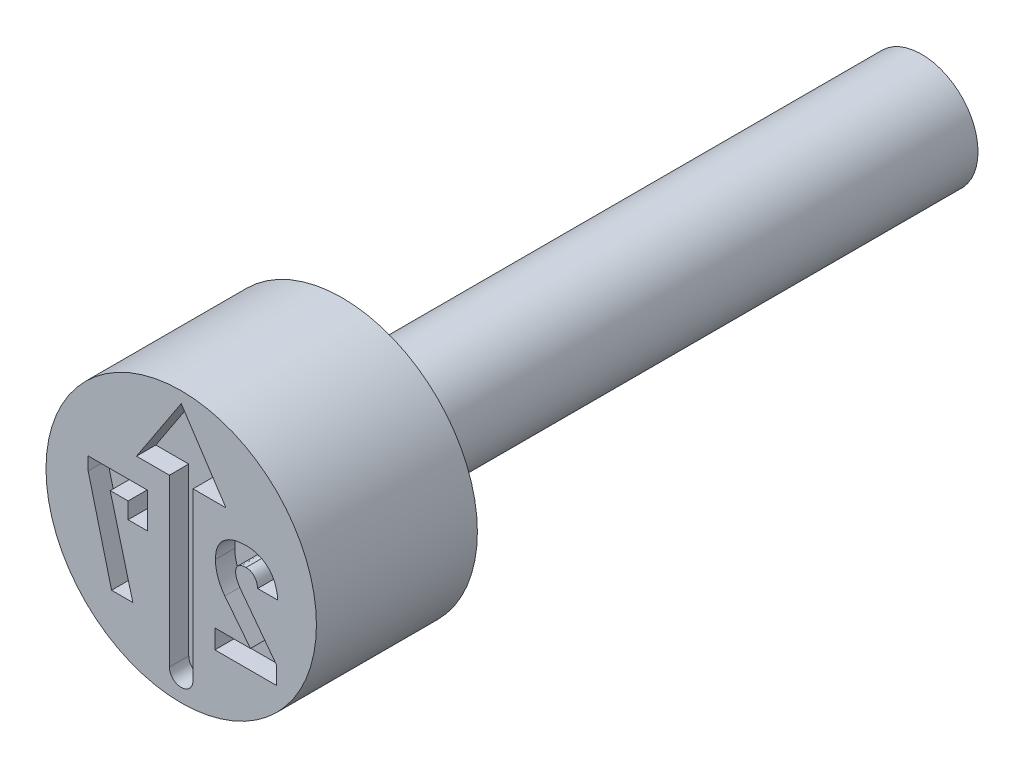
ISO-10303-21;
HEADER;
FILE_DESCRIPTION(('STEP AP214'),'2;1');
FILE_NAME('part.step','',(''),(''),'','','');
FILE_SCHEMA(('AUTOMOTIVE_DESIGN { 1 0 10303 214 1 1 1 1 }'));
ENDSEC;
DATA;
#1=APPLICATION_CONTEXT('core data for automotive mechanical design processes');
#2=APPLICATION_PROTOCOL_DEFINITION('international standard','automotive_design',2000,#1);
#3=PRODUCT_CONTEXT('',#1,'mechanical');
#4=PRODUCT('Part','Part','',(#3));
#5=PRODUCT_RELATED_PRODUCT_CATEGORY('part','',(#4));
#6=PRODUCT_DEFINITION_FORMATION('','',#4);
#7=PRODUCT_DEFINITION_CONTEXT('part definition',#1,'design');
#8=PRODUCT_DEFINITION('design','',#6,#7);
#9=PRODUCT_DEFINITION_SHAPE('','',#8);
#10=(LENGTH_UNIT() NAMED_UNIT(*) SI_UNIT(.MILLI.,.METRE.));
#11=(NAMED_UNIT(*) PLANE_ANGLE_UNIT() SI_UNIT($,.RADIAN.));
#12=(NAMED_UNIT(*) SI_UNIT($,.STERADIAN.) SOLID_ANGLE_UNIT());
#13=UNCERTAINTY_MEASURE_WITH_UNIT(LENGTH_MEASURE(1.E-05),#10,'distance_accuracy_value','');
#14=(GEOMETRIC_REPRESENTATION_CONTEXT(3) GLOBAL_UNCERTAINTY_ASSIGNED_CONTEXT((#13)) GLOBAL_UNIT_ASSIGNED_CONTEXT((#10,
#11,#12)) REPRESENTATION_CONTEXT('',''));
#15=CARTESIAN_POINT('',(0.,0.,0.));
#16=DIRECTION('',(0.,0.,1.));
#17=DIRECTION('',(1.,0.,0.));
#18=AXIS2_PLACEMENT_3D('',#15,#16,#17);
#19=CARTESIAN_POINT('',(0.,1.75,-5.));
#20=DIRECTION('',(0.,0.,1.));
#21=DIRECTION('',(1.,0.,0.));
#22=AXIS2_PLACEMENT_3D('',#19,#20,#21);
#23=PLANE('',#22);
#24=CARTESIAN_POINT('',(0.,0.,-5.));
#25=DIRECTION('',(0.,0.,1.));
#26=DIRECTION('',(1.,0.,0.));
#27=AXIS2_PLACEMENT_3D('',#24,#25,#26);
#28=CIRCLE('',#27,4.2);
#29=CARTESIAN_POINT('',(4.2,0.,-5.));
#30=VERTEX_POINT('',#29);
#31=EDGE_CURVE('E11',#30,#30,#28,.T.);
#32=ORIENTED_EDGE('',*,*,#31,.F.);
#33=EDGE_LOOP('',(#32));
#34=FACE_BOUND('',#33,.T.);
#35=CARTESIAN_POINT('',(0.,0.,-5.));
#36=DIRECTION('',(0.,0.,1.));
#37=DIRECTION('',(1.,0.,0.));
#38=AXIS2_PLACEMENT_3D('',#35,#36,#37);
#39=CIRCLE('',#38,1.75);
#40=CARTESIAN_POINT('',(1.75,0.,-5.));
#41=VERTEX_POINT('',#40);
#42=EDGE_CURVE('E430',#41,#41,#39,.T.);
#43=ORIENTED_EDGE('',*,*,#42,.T.);
#44=EDGE_LOOP('',(#43));
#45=FACE_BOUND('',#44,.T.);
#46=ADVANCED_FACE('F39',(#34,#45),#23,.F.);
#47=CARTESIAN_POINT('',(0.,0.,-0.403888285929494));
#48=DIRECTION('',(0.,0.,1.));
#49=DIRECTION('',(1.,0.,0.));
#50=AXIS2_PLACEMENT_3D('',#47,#48,#49);
#51=CYLINDRICAL_SURFACE('',#50,4.2);
#52=CARTESIAN_POINT('',(0.,0.,0.));
#53=DIRECTION('',(0.,0.,1.));
#54=DIRECTION('',(1.,0.,0.));
#55=AXIS2_PLACEMENT_3D('',#52,#53,#54);
#56=CIRCLE('',#55,4.2);
#57=CARTESIAN_POINT('',(4.2,0.,0.));
#58=VERTEX_POINT('',#57);
#59=EDGE_CURVE('E46',#58,#58,#56,.T.);
#60=ORIENTED_EDGE('',*,*,#59,.F.);
#61=EDGE_LOOP('',(#60));
#62=FACE_BOUND('',#61,.T.);
#63=ORIENTED_EDGE('',*,*,#31,.T.);
#64=EDGE_LOOP('',(#63));
#65=FACE_BOUND('',#64,.T.);
#66=ADVANCED_FACE('F415',(#62,#65),#51,.T.);
#67=CARTESIAN_POINT('',(0.,4.2,0.));
#68=DIRECTION('',(0.,0.,-1.));
#69=DIRECTION('',(-1.,0.,0.));
#70=AXIS2_PLACEMENT_3D('',#67,#68,#69);
#71=PLANE('',#70);
#72=DIRECTION('',(0.,-1.,0.));
#73=VECTOR('',#72,1.);
#74=CARTESIAN_POINT('',(-2.88900162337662,1.,0.));
#75=LINE('',#74,#73);
#76=CARTESIAN_POINT('',(-2.88900162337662,1.,0.));
#77=VERTEX_POINT('',#76);
#78=CARTESIAN_POINT('',(-2.88900162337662,0.592431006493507,0.));
#79=VERTEX_POINT('',#78);
#80=EDGE_CURVE('E297',#77,#79,#75,.T.);
#81=ORIENTED_EDGE('',*,*,#80,.F.);
#82=DIRECTION('',(-1.,0.,0.));
#83=VECTOR('',#82,1.);
#84=CARTESIAN_POINT('',(-1.03977272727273,1.,0.));
#85=LINE('',#84,#83);
#86=CARTESIAN_POINT('',(-1.03977272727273,1.,0.));
#87=VERTEX_POINT('',#86);
#88=EDGE_CURVE('E53',#87,#77,#85,.T.);
#89=ORIENTED_EDGE('',*,*,#88,.F.);
#90=DIRECTION('',(0.,1.,0.));
#91=VECTOR('',#90,1.);
#92=CARTESIAN_POINT('',(-1.03977272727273,-0.0974025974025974,0.));
#93=LINE('',#92,#91);
#94=CARTESIAN_POINT('',(-1.03977272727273,-0.0974025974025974,0.));
#95=VERTEX_POINT('',#94);
#96=EDGE_CURVE('E274',#95,#87,#93,.T.);
#97=ORIENTED_EDGE('',*,*,#96,.F.);
#98=DIRECTION('',(1.,0.,0.));
#99=VECTOR('',#98,1.);
#100=CARTESIAN_POINT('',(-1.64980722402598,-0.0974025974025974,0.));
#101=LINE('',#100,#99);
#102=CARTESIAN_POINT('',(-1.64980722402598,-0.0974025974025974,0.));
#103=VERTEX_POINT('',#102);
#104=EDGE_CURVE('E277',#103,#95,#101,.T.);
#105=ORIENTED_EDGE('',*,*,#104,.F.);
#106=DIRECTION('',(0.,-1.,0.));
#107=VECTOR('',#106,1.);
#108=CARTESIAN_POINT('',(-1.64980722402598,0.409090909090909,0.));
#109=LINE('',#108,#107);
#110=CARTESIAN_POINT('',(-1.64980722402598,0.409090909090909,0.));
#111=VERTEX_POINT('',#110);
#112=EDGE_CURVE('E311',#111,#103,#109,.T.);
#113=ORIENTED_EDGE('',*,*,#112,.F.);
#114=DIRECTION('',(1.,0.,0.));
#115=VECTOR('',#114,1.);
#116=CARTESIAN_POINT('',(-2.20576298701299,0.409090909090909,0.));
#117=LINE('',#116,#115);
#118=CARTESIAN_POINT('',(-2.20576298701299,0.409090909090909,0.));
#119=VERTEX_POINT('',#118);
#120=EDGE_CURVE('E308',#119,#111,#117,.T.);
#121=ORIENTED_EDGE('',*,*,#120,.F.);
#122=DIRECTION('',(-0.255602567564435,0.966781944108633,0.));
#123=VECTOR('',#122,1.);
#124=CARTESIAN_POINT('',(-1.50273944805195,-2.25,0.));
#125=LINE('',#124,#123);
#126=CARTESIAN_POINT('',(-1.50273944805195,-2.25,0.));
#127=VERTEX_POINT('',#126);
#128=EDGE_CURVE('E305',#127,#119,#125,.T.);
#129=ORIENTED_EDGE('',*,*,#128,.F.);
#130=DIRECTION('',(1.,0.,0.));
#131=VECTOR('',#130,1.);
#132=CARTESIAN_POINT('',(-2.1635551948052,-2.25,0.));
#133=LINE('',#132,#131);
#134=CARTESIAN_POINT('',(-2.1635551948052,-2.25,0.));
#135=VERTEX_POINT('',#134);
#136=EDGE_CURVE('E302',#135,#127,#133,.T.);
#137=ORIENTED_EDGE('',*,*,#136,.F.);
#138=DIRECTION('',(0.247293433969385,-0.968940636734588,0.));
#139=VECTOR('',#138,1.);
#140=CARTESIAN_POINT('',(-2.88900162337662,0.592431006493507,0.));
#141=LINE('',#140,#139);
#142=EDGE_CURVE('E299',#79,#135,#141,.T.);
#143=ORIENTED_EDGE('',*,*,#142,.F.);
#144=EDGE_LOOP('',(#81,#89,#97,#105,#113,#121,#129,#137,#143));
#145=FACE_BOUND('',#144,.T.);
#146=DIRECTION('',(0.,1.,0.));
#147=VECTOR('',#146,1.);
#148=CARTESIAN_POINT('',(2.95928368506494,-2.25,0.));
#149=LINE('',#148,#147);
#150=CARTESIAN_POINT('',(2.95928368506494,-2.25,0.));
#151=VERTEX_POINT('',#150);
#152=CARTESIAN_POINT('',(2.95928368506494,-1.69734172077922,0.));
#153=VERTEX_POINT('',#152);
#154=EDGE_CURVE('E602',#151,#153,#149,.T.);
#155=ORIENTED_EDGE('',*,*,#154,.F.);
#156=DIRECTION('',(1.,0.,0.));
#157=VECTOR('',#156,1.);
#158=CARTESIAN_POINT('',(1.04542410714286,-2.25,0.));
#159=LINE('',#158,#157);
#160=CARTESIAN_POINT('',(1.04542410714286,-2.25,0.));
#161=VERTEX_POINT('',#160);
#162=EDGE_CURVE('E61',#161,#151,#159,.T.);
#163=ORIENTED_EDGE('',*,*,#162,.F.);
#164=DIRECTION('',(0.,-1.,0.));
#165=VECTOR('',#164,1.);
#166=CARTESIAN_POINT('',(1.04542410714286,-1.65909090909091,0.));
#167=LINE('',#166,#165);
#168=CARTESIAN_POINT('',(1.04542410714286,-1.65909090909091,0.));
#169=VERTEX_POINT('',#168);
#170=EDGE_CURVE('E335',#169,#161,#167,.T.);
#171=ORIENTED_EDGE('',*,*,#170,.F.);
#172=DIRECTION('',(-1.,0.,0.));
#173=VECTOR('',#172,1.);
#174=CARTESIAN_POINT('',(2.15140016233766,-1.65909090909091,0.));
#175=LINE('',#174,#173);
#176=CARTESIAN_POINT('',(2.15140016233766,-1.65909090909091,0.));
#177=VERTEX_POINT('',#176);
#178=EDGE_CURVE('E530',#177,#169,#175,.T.);
#179=ORIENTED_EDGE('',*,*,#178,.F.);
#180=DIRECTION('',(0.618183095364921,-0.78603413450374,0.));
#181=VECTOR('',#180,1.);
#182=CARTESIAN_POINT('',(1.35472808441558,-0.646103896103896,0.));
#183=LINE('',#182,#181);
#184=CARTESIAN_POINT('',(1.35472808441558,-0.646103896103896,0.));
#185=VERTEX_POINT('',#184);
#186=EDGE_CURVE('E533',#185,#177,#183,.T.);
#187=ORIENTED_EDGE('',*,*,#186,.F.);
#188=CARTESIAN_POINT('',(1.06323051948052,0.190137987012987,0.));
#189=CARTESIAN_POINT('',(1.06407135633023,0.153159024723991,0.));
#190=CARTESIAN_POINT('',(1.06575451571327,0.0791357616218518,0.));
#191=CARTESIAN_POINT('',(1.08094773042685,-0.0316503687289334,0.));
#192=CARTESIAN_POINT('',(1.10543130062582,-0.14187088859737,0.));
#193=CARTESIAN_POINT('',(1.13905588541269,-0.25099331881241,0.));
#194=CARTESIAN_POINT('',(1.18082622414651,-0.357127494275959,0.));
#195=CARTESIAN_POINT('',(1.23095866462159,-0.458819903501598,0.));
#196=CARTESIAN_POINT('',(1.28753955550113,-0.556115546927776,0.));
#197=CARTESIAN_POINT('',(1.33237479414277,-0.616165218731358,0.));
#198=CARTESIAN_POINT('',(1.35472808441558,-0.646103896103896,0.));
#199=B_SPLINE_CURVE_WITH_KNOTS('',3,(#188,#189,#190,#191,#192,#193,#194,#195,#196,#197,#198),
.UNSPECIFIED.,.F.,.F.,(4,1,1,1,1,1,1,1,4),(0.,0.123046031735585,0.246309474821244,
0.371480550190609,0.498560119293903,0.626024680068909,0.750715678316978,0.875715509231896,1.),.UNSPECIFIED.);
#200=CARTESIAN_POINT('',(1.06323051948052,0.190137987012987,0.));
#201=VERTEX_POINT('',#200);
#202=EDGE_CURVE('E536',#201,#185,#199,.T.);
#203=ORIENTED_EDGE('',*,*,#202,.F.);
#204=DIRECTION('',(0.,-1.,0.));
#205=VECTOR('',#204,1.);
#206=CARTESIAN_POINT('',(1.06323051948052,0.192775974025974,0.));
#207=LINE('',#206,#205);
#208=CARTESIAN_POINT('',(1.06323051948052,0.192775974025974,0.));
#209=VERTEX_POINT('',#208);
#210=EDGE_CURVE('E541',#209,#201,#207,.T.);
#211=ORIENTED_EDGE('',*,*,#210,.F.);
#212=CARTESIAN_POINT('',(2.02016030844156,1.04220779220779,0.));
#213=CARTESIAN_POINT('',(1.98319868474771,1.04168274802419,0.));
#214=CARTESIAN_POINT('',(1.91131321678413,1.04066160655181,0.));
#215=CARTESIAN_POINT('',(1.80666041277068,1.02963870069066,0.));
#216=CARTESIAN_POINT('',(1.70819322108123,1.01300192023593,0.));
#217=CARTESIAN_POINT('',(1.61607009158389,0.988663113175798,0.));
#218=CARTESIAN_POINT('',(1.53066085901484,0.956915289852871,0.));
#219=CARTESIAN_POINT('',(1.45170966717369,0.918635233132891,0.));
#220=CARTESIAN_POINT('',(1.37905147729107,0.873496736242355,0.));
#221=CARTESIAN_POINT('',(1.31324273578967,0.821403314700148,0.));
#222=CARTESIAN_POINT('',(1.25403113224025,0.763301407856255,0.));
#223=CARTESIAN_POINT('',(1.20306591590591,0.698601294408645,0.));
#224=CARTESIAN_POINT('',(1.15894707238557,0.628610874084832,0.));
#225=CARTESIAN_POINT('',(1.12445967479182,0.551972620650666,0.));
#226=CARTESIAN_POINT('',(1.09606687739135,0.470488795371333,0.));
#227=CARTESIAN_POINT('',(1.07768298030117,0.382698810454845,0.));
#228=CARTESIAN_POINT('',(1.06529457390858,0.289636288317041,0.));
#229=CARTESIAN_POINT('',(1.06392943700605,0.225574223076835,0.));
#230=CARTESIAN_POINT('',(1.06323051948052,0.192775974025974,0.));
#231=B_SPLINE_CURVE_WITH_KNOTS('',3,(#212,#213,#214,#215,#216,#217,#218,#219,#220,#221,#222,
#223,#224,#225,#226,#227,#228,#229,#230),.UNSPECIFIED.,.F.,.F.,(4,1,1,1,1,1,1,1,1,1,1,1,1,1,1,1,
4),(0.,0.076231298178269,0.148259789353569,0.216860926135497,0.282100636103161,
0.344528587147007,0.404571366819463,0.462840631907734,0.520642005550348,0.577409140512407,
0.633580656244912,0.690215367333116,0.747647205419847,0.806597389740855,0.867894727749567,
0.932365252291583,1.),.UNSPECIFIED.);
#232=CARTESIAN_POINT('',(2.02016030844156,1.04220779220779,0.));
#233=VERTEX_POINT('',#232);
#234=EDGE_CURVE('E547',#233,#209,#231,.T.);
#235=ORIENTED_EDGE('',*,*,#234,.F.);
#236=CARTESIAN_POINT('',(2.99951298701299,0.0668120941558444,0.));
#237=CARTESIAN_POINT('',(2.99642800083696,0.104484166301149,0.));
#238=CARTESIAN_POINT('',(2.99040617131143,0.178019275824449,0.));
#239=CARTESIAN_POINT('',(2.97066399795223,0.284391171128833,0.));
#240=CARTESIAN_POINT('',(2.94514801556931,0.384586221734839,0.));
#241=CARTESIAN_POINT('',(2.9126882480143,0.478584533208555,0.));
#242=CARTESIAN_POINT('',(2.87097733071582,0.565297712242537,0.));
#243=CARTESIAN_POINT('',(2.82411384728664,0.646538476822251,0.));
#244=CARTESIAN_POINT('',(2.76774882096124,0.719794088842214,0.));
#245=CARTESIAN_POINT('',(2.70604940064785,0.787515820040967,0.));
#246=CARTESIAN_POINT('',(2.63732728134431,0.847164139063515,0.));
#247=CARTESIAN_POINT('',(2.56405061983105,0.899781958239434,0.));
#248=CARTESIAN_POINT('',(2.4851113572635,0.943568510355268,0.));
#249=CARTESIAN_POINT('',(2.40170958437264,0.979892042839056,0.));
#250=CARTESIAN_POINT('',(2.31292061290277,1.00746057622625,0.));
#251=CARTESIAN_POINT('',(2.21990423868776,1.02811150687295,0.));
#252=CARTESIAN_POINT('',(2.12159280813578,1.04002095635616,0.));
#253=CARTESIAN_POINT('',(2.05448599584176,1.04146774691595,0.));
#254=CARTESIAN_POINT('',(2.02016030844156,1.04220779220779,0.));
#255=B_SPLINE_CURVE_WITH_KNOTS('',3,(#236,#237,#238,#239,#240,#241,#242,#243,#244,#245,#246,
#247,#248,#249,#250,#251,#252,#253,#254),.UNSPECIFIED.,.F.,.F.,(4,1,1,1,1,1,1,1,1,1,1,1,1,1,1,1,
4),(0.,0.0733268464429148,0.143132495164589,0.209679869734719,0.273918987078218,
0.33576228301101,0.396210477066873,0.45560885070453,0.514796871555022,0.573764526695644,
0.631900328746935,0.689592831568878,0.748648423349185,0.808163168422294,0.86976604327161,
0.933384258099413,1.),.UNSPECIFIED.);
#256=CARTESIAN_POINT('',(2.99951298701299,0.0668120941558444,0.));
#257=VERTEX_POINT('',#256);
#258=EDGE_CURVE('E552',#257,#233,#255,.T.);
#259=ORIENTED_EDGE('',*,*,#258,.F.);
#260=DIRECTION('',(0.,1.,0.));
#261=VECTOR('',#260,1.);
#262=CARTESIAN_POINT('',(2.99951298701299,0.0648336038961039,0.));
#263=LINE('',#262,#261);
#264=CARTESIAN_POINT('',(2.99951298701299,0.0648336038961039,0.));
#265=VERTEX_POINT('',#264);
#266=EDGE_CURVE('E560',#265,#257,#263,.T.);
#267=ORIENTED_EDGE('',*,*,#266,.F.);
#268=DIRECTION('',(1.,0.,0.));
#269=VECTOR('',#268,1.);
#270=CARTESIAN_POINT('',(2.37431006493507,0.0648336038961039,0.));
#271=LINE('',#270,#269);
#272=CARTESIAN_POINT('',(2.37431006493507,0.0648336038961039,0.));
#273=VERTEX_POINT('',#272);
#274=EDGE_CURVE('E566',#273,#265,#271,.T.);
#275=ORIENTED_EDGE('',*,*,#274,.F.);
#276=DIRECTION('',(0.,-1.,0.));
#277=VECTOR('',#276,1.);
#278=CARTESIAN_POINT('',(2.37431006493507,0.0668120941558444,0.));
#279=LINE('',#278,#277);
#280=CARTESIAN_POINT('',(2.37431006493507,0.0668120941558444,0.));
#281=VERTEX_POINT('',#280);
#282=EDGE_CURVE('E569',#281,#273,#279,.T.);
#283=ORIENTED_EDGE('',*,*,#282,.F.);
#284=CARTESIAN_POINT('',(2.01554383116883,0.451298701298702,0.));
#285=CARTESIAN_POINT('',(2.0394360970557,0.450366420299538,0.));
#286=CARTESIAN_POINT('',(2.08585960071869,0.448554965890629,0.));
#287=CARTESIAN_POINT('',(2.15157998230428,0.428478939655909,0.));
#288=CARTESIAN_POINT('',(2.21080045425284,0.396988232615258,0.));
#289=CARTESIAN_POINT('',(2.261853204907,0.352054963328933,0.));
#290=CARTESIAN_POINT('',(2.30412875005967,0.295639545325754,0.));
#291=CARTESIAN_POINT('',(2.33843944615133,0.229205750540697,0.));
#292=CARTESIAN_POINT('',(2.36174301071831,0.1515541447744,0.));
#293=CARTESIAN_POINT('',(2.36998625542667,0.0959683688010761,0.));
#294=CARTESIAN_POINT('',(2.37431006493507,0.0668120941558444,0.));
#295=B_SPLINE_CURVE_WITH_KNOTS('',3,(#284,#285,#286,#287,#288,#289,#290,#291,#292,#293,#294),
.UNSPECIFIED.,.F.,.F.,(4,1,1,1,1,1,1,1,4),(0.,0.122603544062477,0.238222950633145,
0.350089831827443,0.46555970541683,0.585028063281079,0.711014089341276,0.848418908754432,1.),.UNSPECIFIED.);
#296=CARTESIAN_POINT('',(2.01554383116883,0.451298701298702,0.));
#297=VERTEX_POINT('',#296);
#298=EDGE_CURVE('E572',#297,#281,#295,.T.);
#299=ORIENTED_EDGE('',*,*,#298,.F.);
#300=CARTESIAN_POINT('',(1.69107142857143,0.175629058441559,0.));
#301=CARTESIAN_POINT('',(1.69197233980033,0.196409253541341,0.));
#302=CARTESIAN_POINT('',(1.69369834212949,0.236220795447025,0.));
#303=CARTESIAN_POINT('',(1.70995999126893,0.292316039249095,0.));
#304=CARTESIAN_POINT('',(1.73661196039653,0.341166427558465,0.));
#305=CARTESIAN_POINT('',(1.77478401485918,0.381516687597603,0.));
#306=CARTESIAN_POINT('',(1.8223053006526,0.413431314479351,0.));
#307=CARTESIAN_POINT('',(1.87916583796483,0.435922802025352,0.));
#308=CARTESIAN_POINT('',(1.94462165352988,0.448820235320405,0.));
#309=CARTESIAN_POINT('',(1.99108195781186,0.450443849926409,0.));
#310=CARTESIAN_POINT('',(2.01554383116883,0.451298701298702,0.));
#311=B_SPLINE_CURVE_WITH_KNOTS('',3,(#300,#301,#302,#303,#304,#305,#306,#307,#308,#309,#310),
.UNSPECIFIED.,.F.,.F.,(4,1,1,1,1,1,1,1,4),(0.,0.128749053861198,0.246662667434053,
0.359069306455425,0.471077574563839,0.588039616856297,0.711712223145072,0.848213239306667,1.),.UNSPECIFIED.);
#312=CARTESIAN_POINT('',(1.69107142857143,0.175629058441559,0.));
#313=VERTEX_POINT('',#312);
#314=EDGE_CURVE('E577',#313,#297,#311,.T.);
#315=ORIENTED_EDGE('',*,*,#314,.F.);
#316=DIRECTION('',(0.,1.,0.));
#317=VECTOR('',#316,1.);
#318=CARTESIAN_POINT('',(1.69107142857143,0.171012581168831,0.));
#319=LINE('',#318,#317);
#320=CARTESIAN_POINT('',(1.69107142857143,0.171012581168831,0.));
#321=VERTEX_POINT('',#320);
#322=EDGE_CURVE('E585',#321,#313,#319,.T.);
#323=ORIENTED_EDGE('',*,*,#322,.F.);
#324=CARTESIAN_POINT('',(1.8486911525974,-0.226004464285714,0.));
#325=CARTESIAN_POINT('',(1.82542959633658,-0.193227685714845,0.));
#326=CARTESIAN_POINT('',(1.78010516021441,-0.129363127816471,0.));
#327=CARTESIAN_POINT('',(1.73908305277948,-0.0416581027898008,0.));
#328=CARTESIAN_POINT('',(1.71352797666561,0.0271037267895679,0.));
#329=CARTESIAN_POINT('',(1.70134899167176,0.0769696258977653,0.));
#330=CARTESIAN_POINT('',(1.69266088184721,0.124546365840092,0.));
#331=CARTESIAN_POINT('',(1.69159152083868,0.155808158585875,0.));
#332=CARTESIAN_POINT('',(1.69107142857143,0.171012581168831,0.));
#333=B_SPLINE_CURVE_WITH_KNOTS('',3,(#324,#325,#326,#327,#328,#329,#330,#331,#332),
.UNSPECIFIED.,.F.,.F.,(4,1,1,1,1,1,4),(0.,0.277375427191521,0.54045759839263,0.666416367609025,
0.78400940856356,0.894951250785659,1.),.UNSPECIFIED.);
#334=CARTESIAN_POINT('',(1.8486911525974,-0.226004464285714,0.));
#335=VERTEX_POINT('',#334);
#336=EDGE_CURVE('E591',#335,#321,#333,.T.);
#337=ORIENTED_EDGE('',*,*,#336,.F.);
#338=DIRECTION('',(-0.602458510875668,0.798150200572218,0.));
#339=VECTOR('',#338,1.);
#340=CARTESIAN_POINT('',(2.95928368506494,-1.69734172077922,0.));
#341=LINE('',#340,#339);
#342=EDGE_CURVE('E596',#153,#335,#341,.T.);
#343=ORIENTED_EDGE('',*,*,#342,.F.);
#344=EDGE_LOOP('',(#155,#163,#171,#179,#187,#203,#211,#235,#259,#267,#275,#283,#299,#315,#323,
#337,#343));
#345=FACE_BOUND('',#344,.T.);
#346=DIRECTION('',(0.,1.,0.));
#347=VECTOR('',#346,1.);
#348=CARTESIAN_POINT('',(0.366422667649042,1.74359356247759,0.));
#349=LINE('',#348,#347);
#350=CARTESIAN_POINT('',(0.366422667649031,-3.4168913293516,0.));
#351=VERTEX_POINT('',#350);
#352=CARTESIAN_POINT('',(0.366422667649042,1.74359356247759,0.));
#353=VERTEX_POINT('',#352);
#354=EDGE_CURVE('E469',#351,#353,#349,.T.);
#355=ORIENTED_EDGE('',*,*,#354,.F.);
#356=CARTESIAN_POINT('',(3.14387868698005E-13,-3.4168913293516,0.));
#357=DIRECTION('',(0.,0.,1.));
#358=DIRECTION('',(1.,0.,0.));
#359=AXIS2_PLACEMENT_3D('',#356,#357,#358);
#360=CIRCLE('',#359,0.366422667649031);
#361=CARTESIAN_POINT('',(-0.366422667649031,-3.4168913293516,0.));
#362=VERTEX_POINT('',#361);
#363=EDGE_CURVE('E472',#362,#351,#360,.T.);
#364=ORIENTED_EDGE('',*,*,#363,.F.);
#365=DIRECTION('',(0.,-1.,0.));
#366=VECTOR('',#365,1.);
#367=CARTESIAN_POINT('',(-0.366422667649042,1.74359356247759,0.));
#368=LINE('',#367,#366);
#369=CARTESIAN_POINT('',(-0.366422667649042,1.74359356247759,0.));
#370=VERTEX_POINT('',#369);
#371=EDGE_CURVE('E453',#370,#362,#368,.T.);
#372=ORIENTED_EDGE('',*,*,#371,.F.);
#373=DIRECTION('',(1.,0.,0.));
#374=VECTOR('',#373,1.);
#375=CARTESIAN_POINT('',(-1.38878912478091,1.74359356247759,0.));
#376=LINE('',#375,#374);
#377=CARTESIAN_POINT('',(-1.38878912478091,1.74359356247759,0.));
#378=VERTEX_POINT('',#377);
#379=EDGE_CURVE('E457',#378,#370,#376,.T.);
#380=ORIENTED_EDGE('',*,*,#379,.F.);
#381=DIRECTION('',(-0.550159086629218,-0.835059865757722,0.));
#382=VECTOR('',#381,1.);
#383=CARTESIAN_POINT('',(0.,3.85156939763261,0.));
#384=LINE('',#383,#382);
#385=CARTESIAN_POINT('',(0.,3.85156939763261,0.));
#386=VERTEX_POINT('',#385);
#387=EDGE_CURVE('E460',#386,#378,#384,.T.);
#388=ORIENTED_EDGE('',*,*,#387,.F.);
#389=DIRECTION('',(-0.550159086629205,0.835059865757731,0.));
#390=VECTOR('',#389,1.);
#391=CARTESIAN_POINT('',(0.,3.85156939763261,0.));
#392=LINE('',#391,#390);
#393=CARTESIAN_POINT('',(1.38878912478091,1.74359356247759,0.));
#394=VERTEX_POINT('',#393);
#395=EDGE_CURVE('E463',#394,#386,#392,.T.);
#396=ORIENTED_EDGE('',*,*,#395,.F.);
#397=DIRECTION('',(1.,0.,0.));
#398=VECTOR('',#397,1.);
#399=CARTESIAN_POINT('',(1.38878912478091,1.74359356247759,0.));
#400=LINE('',#399,#398);
#401=EDGE_CURVE('E466',#353,#394,#400,.T.);
#402=ORIENTED_EDGE('',*,*,#401,.F.);
#403=EDGE_LOOP('',(#355,#364,#372,#380,#388,#396,#402));
#404=FACE_BOUND('',#403,.T.);
#405=ORIENTED_EDGE('',*,*,#59,.T.);
#406=EDGE_LOOP('',(#405));
#407=FACE_BOUND('',#406,.T.);
#408=ADVANCED_FACE('F412',(#145,#345,#404,#407),#71,.F.);
#409=CARTESIAN_POINT('',(0.,0.,-23.));
#410=DIRECTION('',(0.,0.,1.));
#411=DIRECTION('',(1.,0.,0.));
#412=AXIS2_PLACEMENT_3D('',#409,#410,#411);
#413=PLANE('',#412);
#414=CARTESIAN_POINT('',(0.,0.,-23.));
#415=DIRECTION('',(0.,0.,1.));
#416=DIRECTION('',(1.,0.,0.));
#417=AXIS2_PLACEMENT_3D('',#414,#415,#416);
#418=CIRCLE('',#417,1.75);
#419=CARTESIAN_POINT('',(1.75,0.,-23.));
#420=VERTEX_POINT('',#419);
#421=EDGE_CURVE('E431',#420,#420,#418,.T.);
#422=ORIENTED_EDGE('',*,*,#421,.F.);
#423=EDGE_LOOP('',(#422));
#424=FACE_BOUND('',#423,.T.);
#425=ADVANCED_FACE('F408',(#424),#413,.F.);
#426=CARTESIAN_POINT('',(0.,0.,-0.403888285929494));
#427=DIRECTION('',(0.,0.,1.));
#428=DIRECTION('',(1.,0.,0.));
#429=AXIS2_PLACEMENT_3D('',#426,#427,#428);
#430=CYLINDRICAL_SURFACE('',#429,1.75);
#431=ORIENTED_EDGE('',*,*,#42,.F.);
#432=EDGE_LOOP('',(#431));
#433=FACE_BOUND('',#432,.T.);
#434=ORIENTED_EDGE('',*,*,#421,.T.);
#435=EDGE_LOOP('',(#434));
#436=FACE_BOUND('',#435,.T.);
#437=ADVANCED_FACE('F404',(#433,#436),#430,.T.);
#438=CARTESIAN_POINT('',(3.14387868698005E-13,-3.4168913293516,-0.6));
#439=DIRECTION('',(0.,0.,1.));
#440=DIRECTION('',(1.,0.,0.));
#441=AXIS2_PLACEMENT_3D('',#438,#439,#440);
#442=CYLINDRICAL_SURFACE('',#441,0.366422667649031);
#443=ORIENTED_EDGE('',*,*,#363,.T.);
#444=DIRECTION('',(0.,0.,1.));
#445=VECTOR('',#444,1.);
#446=CARTESIAN_POINT('',(0.366422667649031,-3.4168913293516,-0.6));
#447=LINE('',#446,#445);
#448=CARTESIAN_POINT('',(0.366422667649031,-3.4168913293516,-0.6));
#449=VERTEX_POINT('',#448);
#450=EDGE_CURVE('E439',#449,#351,#447,.T.);
#451=ORIENTED_EDGE('',*,*,#450,.F.);
#452=CARTESIAN_POINT('',(3.14387868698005E-13,-3.4168913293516,-0.6));
#453=DIRECTION('',(0.,0.,1.));
#454=DIRECTION('',(1.,0.,0.));
#455=AXIS2_PLACEMENT_3D('',#452,#453,#454);
#456=CIRCLE('',#455,0.366422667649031);
#457=CARTESIAN_POINT('',(-0.366422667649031,-3.4168913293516,-0.6));
#458=VERTEX_POINT('',#457);
#459=EDGE_CURVE('E456',#458,#449,#456,.T.);
#460=ORIENTED_EDGE('',*,*,#459,.F.);
#461=DIRECTION('',(0.,0.,1.));
#462=VECTOR('',#461,1.);
#463=CARTESIAN_POINT('',(-0.366422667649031,-3.4168913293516,-0.6));
#464=LINE('',#463,#462);
#465=EDGE_CURVE('E432',#458,#362,#464,.T.);
#466=ORIENTED_EDGE('',*,*,#465,.T.);
#467=EDGE_LOOP('',(#443,#451,#460,#466));
#468=FACE_BOUND('',#467,.T.);
#469=ADVANCED_FACE('F382',(#468),#442,.F.);
#470=CARTESIAN_POINT('',(-0.366422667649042,1.74359356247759,-0.6));
#471=DIRECTION('',(-1.,0.,0.));
#472=DIRECTION('',(0.,-1.,0.));
#473=AXIS2_PLACEMENT_3D('',#470,#471,#472);
#474=PLANE('',#473);
#475=ORIENTED_EDGE('',*,*,#371,.T.);
#476=ORIENTED_EDGE('',*,*,#465,.F.);
#477=DIRECTION('',(0.,-1.,0.));
#478=VECTOR('',#477,1.);
#479=CARTESIAN_POINT('',(-0.366422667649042,1.74359356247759,-0.6));
#480=LINE('',#479,#478);
#481=CARTESIAN_POINT('',(-0.366422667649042,1.74359356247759,-0.6));
#482=VERTEX_POINT('',#481);
#483=EDGE_CURVE('E444',#482,#458,#480,.T.);
#484=ORIENTED_EDGE('',*,*,#483,.F.);
#485=DIRECTION('',(0.,0.,1.));
#486=VECTOR('',#485,1.);
#487=CARTESIAN_POINT('',(-0.366422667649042,1.74359356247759,-0.6));
#488=LINE('',#487,#486);
#489=EDGE_CURVE('E436',#482,#370,#488,.T.);
#490=ORIENTED_EDGE('',*,*,#489,.T.);
#491=EDGE_LOOP('',(#475,#476,#484,#490));
#492=FACE_BOUND('',#491,.T.);
#493=ADVANCED_FACE('F378',(#492),#474,.F.);
#494=CARTESIAN_POINT('',(-1.38878912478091,1.74359356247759,-0.6));
#495=DIRECTION('',(0.,-1.,0.));
#496=DIRECTION('',(0.,0.,-1.));
#497=AXIS2_PLACEMENT_3D('',#494,#495,#496);
#498=PLANE('',#497);
#499=ORIENTED_EDGE('',*,*,#379,.T.);
#500=ORIENTED_EDGE('',*,*,#489,.F.);
#501=DIRECTION('',(1.,0.,0.));
#502=VECTOR('',#501,1.);
#503=CARTESIAN_POINT('',(-1.38878912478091,1.74359356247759,-0.6));
#504=LINE('',#503,#502);
#505=CARTESIAN_POINT('',(-1.38878912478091,1.74359356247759,-0.6));
#506=VERTEX_POINT('',#505);
#507=EDGE_CURVE('E477',#506,#482,#504,.T.);
#508=ORIENTED_EDGE('',*,*,#507,.F.);
#509=DIRECTION('',(0.,0.,1.));
#510=VECTOR('',#509,1.);
#511=CARTESIAN_POINT('',(-1.38878912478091,1.74359356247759,-0.6));
#512=LINE('',#511,#510);
#513=EDGE_CURVE('E450',#506,#378,#512,.T.);
#514=ORIENTED_EDGE('',*,*,#513,.T.);
#515=EDGE_LOOP('',(#499,#500,#508,#514));
#516=FACE_BOUND('',#515,.T.);
#517=ADVANCED_FACE('F381',(#516),#498,.F.);
#518=CARTESIAN_POINT('',(0.,3.85156939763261,-0.6));
#519=DIRECTION('',(-0.835059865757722,0.550159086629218,0.));
#520=DIRECTION('',(-0.550159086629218,-0.835059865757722,0.));
#521=AXIS2_PLACEMENT_3D('',#518,#519,#520);
#522=PLANE('',#521);
#523=ORIENTED_EDGE('',*,*,#387,.T.);
#524=ORIENTED_EDGE('',*,*,#513,.F.);
#525=DIRECTION('',(-0.550159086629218,-0.835059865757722,0.));
#526=VECTOR('',#525,1.);
#527=CARTESIAN_POINT('',(0.,3.85156939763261,-0.6));
#528=LINE('',#527,#526);
#529=CARTESIAN_POINT('',(0.,3.85156939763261,-0.6));
#530=VERTEX_POINT('',#529);
#531=EDGE_CURVE('E480',#530,#506,#528,.T.);
#532=ORIENTED_EDGE('',*,*,#531,.F.);
#533=DIRECTION('',(0.,0.,1.));
#534=VECTOR('',#533,1.);
#535=CARTESIAN_POINT('',(0.,3.85156939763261,-0.6));
#536=LINE('',#535,#534);
#537=EDGE_CURVE('E448',#530,#386,#536,.T.);
#538=ORIENTED_EDGE('',*,*,#537,.T.);
#539=EDGE_LOOP('',(#523,#524,#532,#538));
#540=FACE_BOUND('',#539,.T.);
#541=ADVANCED_FACE('F386',(#540),#522,.F.);
#542=CARTESIAN_POINT('',(0.,3.85156939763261,-0.6));
#543=DIRECTION('',(0.835059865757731,0.550159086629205,0.));
#544=DIRECTION('',(-0.550159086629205,0.835059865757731,0.));
#545=AXIS2_PLACEMENT_3D('',#542,#543,#544);
#546=PLANE('',#545);
#547=ORIENTED_EDGE('',*,*,#395,.T.);
#548=ORIENTED_EDGE('',*,*,#537,.F.);
#549=DIRECTION('',(-0.550159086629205,0.835059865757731,0.));
#550=VECTOR('',#549,1.);
#551=CARTESIAN_POINT('',(0.,3.85156939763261,-0.6));
#552=LINE('',#551,#550);
#553=CARTESIAN_POINT('',(1.38878912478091,1.74359356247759,-0.6));
#554=VERTEX_POINT('',#553);
#555=EDGE_CURVE('E483',#554,#530,#552,.T.);
#556=ORIENTED_EDGE('',*,*,#555,.F.);
#557=DIRECTION('',(0.,0.,1.));
#558=VECTOR('',#557,1.);
#559=CARTESIAN_POINT('',(1.38878912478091,1.74359356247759,-0.6));
#560=LINE('',#559,#558);
#561=EDGE_CURVE('E446',#554,#394,#560,.T.);
#562=ORIENTED_EDGE('',*,*,#561,.T.);
#563=EDGE_LOOP('',(#547,#548,#556,#562));
#564=FACE_BOUND('',#563,.T.);
#565=ADVANCED_FACE('F390',(#564),#546,.F.);
#566=CARTESIAN_POINT('',(1.38878912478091,1.74359356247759,-0.6));
#567=DIRECTION('',(0.,-1.,0.));
#568=DIRECTION('',(0.,0.,-1.));
#569=AXIS2_PLACEMENT_3D('',#566,#567,#568);
#570=PLANE('',#569);
#571=ORIENTED_EDGE('',*,*,#401,.T.);
#572=ORIENTED_EDGE('',*,*,#561,.F.);
#573=DIRECTION('',(1.,0.,0.));
#574=VECTOR('',#573,1.);
#575=CARTESIAN_POINT('',(1.38878912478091,1.74359356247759,-0.6));
#576=LINE('',#575,#574);
#577=CARTESIAN_POINT('',(0.366422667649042,1.74359356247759,-0.6));
#578=VERTEX_POINT('',#577);
#579=EDGE_CURVE('E486',#578,#554,#576,.T.);
#580=ORIENTED_EDGE('',*,*,#579,.F.);
#581=DIRECTION('',(0.,0.,1.));
#582=VECTOR('',#581,1.);
#583=CARTESIAN_POINT('',(0.366422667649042,1.74359356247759,-0.6));
#584=LINE('',#583,#582);
#585=EDGE_CURVE('E443',#578,#353,#584,.T.);
#586=ORIENTED_EDGE('',*,*,#585,.T.);
#587=EDGE_LOOP('',(#571,#572,#580,#586));
#588=FACE_BOUND('',#587,.T.);
#589=ADVANCED_FACE('F394',(#588),#570,.F.);
#590=CARTESIAN_POINT('',(0.366422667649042,1.74359356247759,-0.6));
#591=DIRECTION('',(1.,0.,0.));
#592=DIRECTION('',(0.,1.,0.));
#593=AXIS2_PLACEMENT_3D('',#590,#591,#592);
#594=PLANE('',#593);
#595=ORIENTED_EDGE('',*,*,#354,.T.);
#596=ORIENTED_EDGE('',*,*,#585,.F.);
#597=DIRECTION('',(0.,1.,0.));
#598=VECTOR('',#597,1.);
#599=CARTESIAN_POINT('',(0.366422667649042,1.74359356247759,-0.6));
#600=LINE('',#599,#598);
#601=EDGE_CURVE('E489',#449,#578,#600,.T.);
#602=ORIENTED_EDGE('',*,*,#601,.F.);
#603=ORIENTED_EDGE('',*,*,#450,.T.);
#604=EDGE_LOOP('',(#595,#596,#602,#603));
#605=FACE_BOUND('',#604,.T.);
#606=ADVANCED_FACE('F376',(#605),#594,.F.);
#607=CARTESIAN_POINT('',(3.14387868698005E-13,-3.4168913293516,-0.6));
#608=DIRECTION('',(0.,0.,1.));
#609=DIRECTION('',(1.,0.,0.));
#610=AXIS2_PLACEMENT_3D('',#607,#608,#609);
#611=PLANE('',#610);
#612=ORIENTED_EDGE('',*,*,#459,.T.);
#613=ORIENTED_EDGE('',*,*,#601,.T.);
#614=ORIENTED_EDGE('',*,*,#579,.T.);
#615=ORIENTED_EDGE('',*,*,#555,.T.);
#616=ORIENTED_EDGE('',*,*,#531,.T.);
#617=ORIENTED_EDGE('',*,*,#507,.T.);
#618=ORIENTED_EDGE('',*,*,#483,.T.);
#619=EDGE_LOOP('',(#612,#613,#614,#615,#616,#617,#618));
#620=FACE_BOUND('',#619,.T.);
#621=ADVANCED_FACE('F373',(#620),#611,.T.);
#622=CARTESIAN_POINT('',(1.04542410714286,-2.25,-0.6));
#623=DIRECTION('',(0.,-1.,0.));
#624=DIRECTION('',(0.,0.,-1.));
#625=AXIS2_PLACEMENT_3D('',#622,#623,#624);
#626=PLANE('',#625);
#627=ORIENTED_EDGE('',*,*,#162,.T.);
#628=DIRECTION('',(0.,0.,1.));
#629=VECTOR('',#628,1.);
#630=CARTESIAN_POINT('',(2.95928368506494,-2.25,-0.6));
#631=LINE('',#630,#629);
#632=CARTESIAN_POINT('',(2.95928368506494,-2.25,-0.6));
#633=VERTEX_POINT('',#632);
#634=EDGE_CURVE('E494',#633,#151,#631,.T.);
#635=ORIENTED_EDGE('',*,*,#634,.F.);
#636=DIRECTION('',(1.,0.,0.));
#637=VECTOR('',#636,1.);
#638=CARTESIAN_POINT('',(1.04542410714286,-2.25,-0.6));
#639=LINE('',#638,#637);
#640=CARTESIAN_POINT('',(1.04542410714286,-2.25,-0.6));
#641=VERTEX_POINT('',#640);
#642=EDGE_CURVE('E331',#641,#633,#639,.T.);
#643=ORIENTED_EDGE('',*,*,#642,.F.);
#644=DIRECTION('',(0.,0.,1.));
#645=VECTOR('',#644,1.);
#646=CARTESIAN_POINT('',(1.04542410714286,-2.25,-0.6));
#647=LINE('',#646,#645);
#648=EDGE_CURVE('E474',#641,#161,#647,.T.);
#649=ORIENTED_EDGE('',*,*,#648,.T.);
#650=EDGE_LOOP('',(#627,#635,#643,#649));
#651=FACE_BOUND('',#650,.T.);
#652=ADVANCED_FACE('F369',(#651),#626,.F.);
#653=CARTESIAN_POINT('',(1.04542410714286,-1.65909090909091,-0.6));
#654=DIRECTION('',(-1.,0.,0.));
#655=DIRECTION('',(0.,0.,1.));
#656=AXIS2_PLACEMENT_3D('',#653,#654,#655);
#657=PLANE('',#656);
#658=ORIENTED_EDGE('',*,*,#170,.T.);
#659=ORIENTED_EDGE('',*,*,#648,.F.);
#660=DIRECTION('',(0.,-1.,0.));
#661=VECTOR('',#660,1.);
#662=CARTESIAN_POINT('',(1.04542410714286,-1.65909090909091,-0.6));
#663=LINE('',#662,#661);
#664=CARTESIAN_POINT('',(1.04542410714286,-1.65909090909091,-0.6));
#665=VERTEX_POINT('',#664);
#666=EDGE_CURVE('E497',#665,#641,#663,.T.);
#667=ORIENTED_EDGE('',*,*,#666,.F.);
#668=DIRECTION('',(0.,0.,1.));
#669=VECTOR('',#668,1.);
#670=CARTESIAN_POINT('',(1.04542410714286,-1.65909090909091,-0.6));
#671=LINE('',#670,#669);
#672=EDGE_CURVE('E525',#665,#169,#671,.T.);
#673=ORIENTED_EDGE('',*,*,#672,.T.);
#674=EDGE_LOOP('',(#658,#659,#667,#673));
#675=FACE_BOUND('',#674,.T.);
#676=ADVANCED_FACE('F372',(#675),#657,.F.);
#677=CARTESIAN_POINT('',(2.15140016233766,-1.65909090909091,-0.6));
#678=DIRECTION('',(0.,1.,0.));
#679=DIRECTION('',(0.,0.,1.));
#680=AXIS2_PLACEMENT_3D('',#677,#678,#679);
#681=PLANE('',#680);
#682=ORIENTED_EDGE('',*,*,#178,.T.);
#683=ORIENTED_EDGE('',*,*,#672,.F.);
#684=DIRECTION('',(-1.,0.,0.));
#685=VECTOR('',#684,1.);
#686=CARTESIAN_POINT('',(2.15140016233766,-1.65909090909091,-0.6));
#687=LINE('',#686,#685);
#688=CARTESIAN_POINT('',(2.15140016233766,-1.65909090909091,-0.6));
#689=VERTEX_POINT('',#688);
#690=EDGE_CURVE('E608',#689,#665,#687,.T.);
#691=ORIENTED_EDGE('',*,*,#690,.F.);
#692=DIRECTION('',(0.,0.,1.));
#693=VECTOR('',#692,1.);
#694=CARTESIAN_POINT('',(2.15140016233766,-1.65909090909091,-0.6));
#695=LINE('',#694,#693);
#696=EDGE_CURVE('E523',#689,#177,#695,.T.);
#697=ORIENTED_EDGE('',*,*,#696,.T.);
#698=EDGE_LOOP('',(#682,#683,#691,#697));
#699=FACE_BOUND('',#698,.T.);
#700=ADVANCED_FACE('F724',(#699),#681,.F.);
#701=CARTESIAN_POINT('',(1.35472808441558,-0.646103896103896,-0.6));
#702=DIRECTION('',(-0.786034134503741,-0.618183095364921,0.));
#703=DIRECTION('',(0.618183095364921,-0.78603413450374,0.));
#704=AXIS2_PLACEMENT_3D('',#701,#702,#703);
#705=PLANE('',#704);
#706=ORIENTED_EDGE('',*,*,#186,.T.);
#707=ORIENTED_EDGE('',*,*,#696,.F.);
#708=DIRECTION('',(0.618183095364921,-0.78603413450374,0.));
#709=VECTOR('',#708,1.);
#710=CARTESIAN_POINT('',(1.35472808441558,-0.646103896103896,-0.6));
#711=LINE('',#710,#709);
#712=CARTESIAN_POINT('',(1.35472808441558,-0.646103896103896,-0.6));
#713=VERTEX_POINT('',#712);
#714=EDGE_CURVE('E611',#713,#689,#711,.T.);
#715=ORIENTED_EDGE('',*,*,#714,.F.);
#716=DIRECTION('',(0.,0.,1.));
#717=VECTOR('',#716,1.);
#718=CARTESIAN_POINT('',(1.35472808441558,-0.646103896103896,-0.6));
#719=LINE('',#718,#717);
#720=EDGE_CURVE('E521',#713,#185,#719,.T.);
#721=ORIENTED_EDGE('',*,*,#720,.T.);
#722=EDGE_LOOP('',(#706,#707,#715,#721));
#723=FACE_BOUND('',#722,.T.);
#724=ADVANCED_FACE('F631',(#723),#705,.F.);
#725=CARTESIAN_POINT('',(1.06323051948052,0.190137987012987,-0.6));
#726=CARTESIAN_POINT('',(1.06407135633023,0.153159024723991,-0.6));
#727=CARTESIAN_POINT('',(1.06575451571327,0.0791357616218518,-0.6));
#728=CARTESIAN_POINT('',(1.08094773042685,-0.0316503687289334,-0.6));
#729=CARTESIAN_POINT('',(1.10543130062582,-0.14187088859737,-0.6));
#730=CARTESIAN_POINT('',(1.13905588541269,-0.25099331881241,-0.6));
#731=CARTESIAN_POINT('',(1.18082622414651,-0.357127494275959,-0.6));
#732=CARTESIAN_POINT('',(1.23095866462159,-0.458819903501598,-0.6));
#733=CARTESIAN_POINT('',(1.28753955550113,-0.556115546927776,-0.6));
#734=CARTESIAN_POINT('',(1.33237479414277,-0.616165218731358,-0.6));
#735=CARTESIAN_POINT('',(1.35472808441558,-0.646103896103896,-0.6));
#736=B_SPLINE_CURVE_WITH_KNOTS('',3,(#725,#726,#727,#728,#729,#730,#731,#732,#733,#734,#735),
.UNSPECIFIED.,.F.,.F.,(4,1,1,1,1,1,1,1,4),(0.,0.123046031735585,0.246309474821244,
0.371480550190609,0.498560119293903,0.626024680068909,0.750715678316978,0.875715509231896,1.),.UNSPECIFIED.);
#737=DIRECTION('',(0.,0.,1.));
#738=VECTOR('',#737,1.);
#739=SURFACE_OF_LINEAR_EXTRUSION('',#736,#738);
#740=ORIENTED_EDGE('',*,*,#202,.T.);
#741=ORIENTED_EDGE('',*,*,#720,.F.);
#742=CARTESIAN_POINT('',(1.06323051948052,0.190137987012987,-0.6));
#743=VERTEX_POINT('',#742);
#744=EDGE_CURVE('E614',#743,#713,#736,.T.);
#745=ORIENTED_EDGE('',*,*,#744,.F.);
#746=DIRECTION('',(0.,0.,1.));
#747=VECTOR('',#746,1.);
#748=CARTESIAN_POINT('',(1.06323051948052,0.190137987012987,-0.6));
#749=LINE('',#748,#747);
#750=EDGE_CURVE('E519',#743,#201,#749,.T.);
#751=ORIENTED_EDGE('',*,*,#750,.T.);
#752=EDGE_LOOP('',(#740,#741,#745,#751));
#753=FACE_BOUND('',#752,.T.);
#754=ADVANCED_FACE('F626',(#753),#739,.F.);
#755=CARTESIAN_POINT('',(1.06323051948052,0.192775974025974,-0.6));
#756=DIRECTION('',(-1.,0.,0.));
#757=DIRECTION('',(0.,0.,1.));
#758=AXIS2_PLACEMENT_3D('',#755,#756,#757);
#759=PLANE('',#758);
#760=ORIENTED_EDGE('',*,*,#210,.T.);
#761=ORIENTED_EDGE('',*,*,#750,.F.);
#762=DIRECTION('',(0.,-1.,0.));
#763=VECTOR('',#762,1.);
#764=CARTESIAN_POINT('',(1.06323051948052,0.192775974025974,-0.6));
#765=LINE('',#764,#763);
#766=CARTESIAN_POINT('',(1.06323051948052,0.192775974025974,-0.6));
#767=VERTEX_POINT('',#766);
#768=EDGE_CURVE('E620',#767,#743,#765,.T.);
#769=ORIENTED_EDGE('',*,*,#768,.F.);
#770=DIRECTION('',(0.,0.,1.));
#771=VECTOR('',#770,1.);
#772=CARTESIAN_POINT('',(1.06323051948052,0.192775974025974,-0.6));
#773=LINE('',#772,#771);
#774=EDGE_CURVE('E517',#767,#209,#773,.T.);
#775=ORIENTED_EDGE('',*,*,#774,.T.);
#776=EDGE_LOOP('',(#760,#761,#769,#775));
#777=FACE_BOUND('',#776,.T.);
#778=ADVANCED_FACE('F630',(#777),#759,.F.);
#779=CARTESIAN_POINT('',(2.02016030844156,1.04220779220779,-0.6));
#780=CARTESIAN_POINT('',(1.98319868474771,1.04168274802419,-0.6));
#781=CARTESIAN_POINT('',(1.91131321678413,1.04066160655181,-0.6));
#782=CARTESIAN_POINT('',(1.80666041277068,1.02963870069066,-0.6));
#783=CARTESIAN_POINT('',(1.70819322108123,1.01300192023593,-0.6));
#784=CARTESIAN_POINT('',(1.61607009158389,0.988663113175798,-0.6));
#785=CARTESIAN_POINT('',(1.53066085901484,0.956915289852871,-0.6));
#786=CARTESIAN_POINT('',(1.45170966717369,0.918635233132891,-0.6));
#787=CARTESIAN_POINT('',(1.37905147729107,0.873496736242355,-0.6));
#788=CARTESIAN_POINT('',(1.31324273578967,0.821403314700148,-0.6));
#789=CARTESIAN_POINT('',(1.25403113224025,0.763301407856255,-0.6));
#790=CARTESIAN_POINT('',(1.20306591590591,0.698601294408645,-0.6));
#791=CARTESIAN_POINT('',(1.15894707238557,0.628610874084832,-0.6));
#792=CARTESIAN_POINT('',(1.12445967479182,0.551972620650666,-0.6));
#793=CARTESIAN_POINT('',(1.09606687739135,0.470488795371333,-0.6));
#794=CARTESIAN_POINT('',(1.07768298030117,0.382698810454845,-0.6));
#795=CARTESIAN_POINT('',(1.06529457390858,0.289636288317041,-0.6));
#796=CARTESIAN_POINT('',(1.06392943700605,0.225574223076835,-0.6));
#797=CARTESIAN_POINT('',(1.06323051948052,0.192775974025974,-0.6));
#798=B_SPLINE_CURVE_WITH_KNOTS('',3,(#779,#780,#781,#782,#783,#784,#785,#786,#787,#788,#789,
#790,#791,#792,#793,#794,#795,#796,#797),.UNSPECIFIED.,.F.,.F.,(4,1,1,1,1,1,1,1,1,1,1,1,1,1,1,1,
4),(0.,0.076231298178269,0.148259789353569,0.216860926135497,0.282100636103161,
0.344528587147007,0.404571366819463,0.462840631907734,0.520642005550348,0.577409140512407,
0.633580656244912,0.690215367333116,0.747647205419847,0.806597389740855,0.867894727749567,
0.932365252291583,1.),.UNSPECIFIED.);
#799=DIRECTION('',(0.,0.,1.));
#800=VECTOR('',#799,1.);
#801=SURFACE_OF_LINEAR_EXTRUSION('',#798,#800);
#802=ORIENTED_EDGE('',*,*,#234,.T.);
#803=ORIENTED_EDGE('',*,*,#774,.F.);
#804=CARTESIAN_POINT('',(2.02016030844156,1.04220779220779,-0.6));
#805=VERTEX_POINT('',#804);
#806=EDGE_CURVE('E644',#805,#767,#798,.T.);
#807=ORIENTED_EDGE('',*,*,#806,.F.);
#808=DIRECTION('',(0.,0.,1.));
#809=VECTOR('',#808,1.);
#810=CARTESIAN_POINT('',(2.02016030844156,1.04220779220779,-0.6));
#811=LINE('',#810,#809);
#812=EDGE_CURVE('E515',#805,#233,#811,.T.);
#813=ORIENTED_EDGE('',*,*,#812,.T.);
#814=EDGE_LOOP('',(#802,#803,#807,#813));
#815=FACE_BOUND('',#814,.T.);
#816=ADVANCED_FACE('F636',(#815),#801,.F.);
#817=CARTESIAN_POINT('',(2.99951298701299,0.0668120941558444,-0.6));
#818=CARTESIAN_POINT('',(2.99642800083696,0.104484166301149,-0.6));
#819=CARTESIAN_POINT('',(2.99040617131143,0.178019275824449,-0.6));
#820=CARTESIAN_POINT('',(2.97066399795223,0.284391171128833,-0.6));
#821=CARTESIAN_POINT('',(2.94514801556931,0.384586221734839,-0.6));
#822=CARTESIAN_POINT('',(2.9126882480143,0.478584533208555,-0.6));
#823=CARTESIAN_POINT('',(2.87097733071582,0.565297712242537,-0.6));
#824=CARTESIAN_POINT('',(2.82411384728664,0.646538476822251,-0.6));
#825=CARTESIAN_POINT('',(2.76774882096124,0.719794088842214,-0.6));
#826=CARTESIAN_POINT('',(2.70604940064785,0.787515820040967,-0.6));
#827=CARTESIAN_POINT('',(2.63732728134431,0.847164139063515,-0.6));
#828=CARTESIAN_POINT('',(2.56405061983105,0.899781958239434,-0.6));
#829=CARTESIAN_POINT('',(2.4851113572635,0.943568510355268,-0.6));
#830=CARTESIAN_POINT('',(2.40170958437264,0.979892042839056,-0.6));
#831=CARTESIAN_POINT('',(2.31292061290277,1.00746057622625,-0.6));
#832=CARTESIAN_POINT('',(2.21990423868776,1.02811150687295,-0.6));
#833=CARTESIAN_POINT('',(2.12159280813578,1.04002095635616,-0.6));
#834=CARTESIAN_POINT('',(2.05448599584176,1.04146774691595,-0.6));
#835=CARTESIAN_POINT('',(2.02016030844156,1.04220779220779,-0.6));
#836=B_SPLINE_CURVE_WITH_KNOTS('',3,(#817,#818,#819,#820,#821,#822,#823,#824,#825,#826,#827,
#828,#829,#830,#831,#832,#833,#834,#835),.UNSPECIFIED.,.F.,.F.,(4,1,1,1,1,1,1,1,1,1,1,1,1,1,1,1,
4),(0.,0.0733268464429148,0.143132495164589,0.209679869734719,0.273918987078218,
0.33576228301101,0.396210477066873,0.45560885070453,0.514796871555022,0.573764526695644,
0.631900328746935,0.689592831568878,0.748648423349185,0.808163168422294,0.86976604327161,
0.933384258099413,1.),.UNSPECIFIED.);
#837=DIRECTION('',(0.,0.,1.));
#838=VECTOR('',#837,1.);
#839=SURFACE_OF_LINEAR_EXTRUSION('',#836,#838);
#840=ORIENTED_EDGE('',*,*,#258,.T.);
#841=ORIENTED_EDGE('',*,*,#812,.F.);
#842=CARTESIAN_POINT('',(2.99951298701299,0.0668120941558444,-0.6));
#843=VERTEX_POINT('',#842);
#844=EDGE_CURVE('E649',#843,#805,#836,.T.);
#845=ORIENTED_EDGE('',*,*,#844,.F.);
#846=DIRECTION('',(0.,0.,1.));
#847=VECTOR('',#846,1.);
#848=CARTESIAN_POINT('',(2.99951298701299,0.0668120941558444,-0.6));
#849=LINE('',#848,#847);
#850=EDGE_CURVE('E513',#843,#257,#849,.T.);
#851=ORIENTED_EDGE('',*,*,#850,.T.);
#852=EDGE_LOOP('',(#840,#841,#845,#851));
#853=FACE_BOUND('',#852,.T.);
#854=ADVANCED_FACE('F640',(#853),#839,.F.);
#855=CARTESIAN_POINT('',(2.99951298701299,0.0648336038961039,-0.6));
#856=DIRECTION('',(1.,0.,0.));
#857=DIRECTION('',(0.,0.,-1.));
#858=AXIS2_PLACEMENT_3D('',#855,#856,#857);
#859=PLANE('',#858);
#860=ORIENTED_EDGE('',*,*,#266,.T.);
#861=ORIENTED_EDGE('',*,*,#850,.F.);
#862=DIRECTION('',(0.,1.,0.));
#863=VECTOR('',#862,1.);
#864=CARTESIAN_POINT('',(2.99951298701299,0.0648336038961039,-0.6));
#865=LINE('',#864,#863);
#866=CARTESIAN_POINT('',(2.99951298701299,0.0648336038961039,-0.6));
#867=VERTEX_POINT('',#866);
#868=EDGE_CURVE('E658',#867,#843,#865,.T.);
#869=ORIENTED_EDGE('',*,*,#868,.F.);
#870=DIRECTION('',(0.,0.,1.));
#871=VECTOR('',#870,1.);
#872=CARTESIAN_POINT('',(2.99951298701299,0.0648336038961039,-0.6));
#873=LINE('',#872,#871);
#874=EDGE_CURVE('E511',#867,#265,#873,.T.);
#875=ORIENTED_EDGE('',*,*,#874,.T.);
#876=EDGE_LOOP('',(#860,#861,#869,#875));
#877=FACE_BOUND('',#876,.T.);
#878=ADVANCED_FACE('F740',(#877),#859,.F.);
#879=CARTESIAN_POINT('',(2.37431006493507,0.0648336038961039,-0.6));
#880=DIRECTION('',(0.,-1.,0.));
#881=DIRECTION('',(0.,0.,-1.));
#882=AXIS2_PLACEMENT_3D('',#879,#880,#881);
#883=PLANE('',#882);
#884=ORIENTED_EDGE('',*,*,#274,.T.);
#885=ORIENTED_EDGE('',*,*,#874,.F.);
#886=DIRECTION('',(1.,0.,0.));
#887=VECTOR('',#886,1.);
#888=CARTESIAN_POINT('',(2.37431006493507,0.0648336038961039,-0.6));
#889=LINE('',#888,#887);
#890=CARTESIAN_POINT('',(2.37431006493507,0.0648336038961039,-0.6));
#891=VERTEX_POINT('',#890);
#892=EDGE_CURVE('E664',#891,#867,#889,.T.);
#893=ORIENTED_EDGE('',*,*,#892,.F.);
#894=DIRECTION('',(0.,0.,1.));
#895=VECTOR('',#894,1.);
#896=CARTESIAN_POINT('',(2.37431006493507,0.0648336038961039,-0.6));
#897=LINE('',#896,#895);
#898=EDGE_CURVE('E509',#891,#273,#897,.T.);
#899=ORIENTED_EDGE('',*,*,#898,.T.);
#900=EDGE_LOOP('',(#884,#885,#893,#899));
#901=FACE_BOUND('',#900,.T.);
#902=ADVANCED_FACE('F743',(#901),#883,.F.);
#903=CARTESIAN_POINT('',(2.37431006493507,0.0668120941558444,-0.6));
#904=DIRECTION('',(-1.,0.,0.));
#905=DIRECTION('',(0.,0.,1.));
#906=AXIS2_PLACEMENT_3D('',#903,#904,#905);
#907=PLANE('',#906);
#908=ORIENTED_EDGE('',*,*,#282,.T.);
#909=ORIENTED_EDGE('',*,*,#898,.F.);
#910=DIRECTION('',(0.,-1.,0.));
#911=VECTOR('',#910,1.);
#912=CARTESIAN_POINT('',(2.37431006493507,0.0668120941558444,-0.6));
#913=LINE('',#912,#911);
#914=CARTESIAN_POINT('',(2.37431006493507,0.0668120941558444,-0.6));
#915=VERTEX_POINT('',#914);
#916=EDGE_CURVE('E667',#915,#891,#913,.T.);
#917=ORIENTED_EDGE('',*,*,#916,.F.);
#918=DIRECTION('',(0.,0.,1.));
#919=VECTOR('',#918,1.);
#920=CARTESIAN_POINT('',(2.37431006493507,0.0668120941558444,-0.6));
#921=LINE('',#920,#919);
#922=EDGE_CURVE('E507',#915,#281,#921,.T.);
#923=ORIENTED_EDGE('',*,*,#922,.T.);
#924=EDGE_LOOP('',(#908,#909,#917,#923));
#925=FACE_BOUND('',#924,.T.);
#926=ADVANCED_FACE('F687',(#925),#907,.F.);
#927=CARTESIAN_POINT('',(2.01554383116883,0.451298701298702,-0.6));
#928=CARTESIAN_POINT('',(2.0394360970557,0.450366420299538,-0.6));
#929=CARTESIAN_POINT('',(2.08585960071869,0.448554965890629,-0.6));
#930=CARTESIAN_POINT('',(2.15157998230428,0.428478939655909,-0.6));
#931=CARTESIAN_POINT('',(2.21080045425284,0.396988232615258,-0.6));
#932=CARTESIAN_POINT('',(2.261853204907,0.352054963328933,-0.6));
#933=CARTESIAN_POINT('',(2.30412875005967,0.295639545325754,-0.6));
#934=CARTESIAN_POINT('',(2.33843944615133,0.229205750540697,-0.6));
#935=CARTESIAN_POINT('',(2.36174301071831,0.1515541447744,-0.6));
#936=CARTESIAN_POINT('',(2.36998625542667,0.0959683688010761,-0.6));
#937=CARTESIAN_POINT('',(2.37431006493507,0.0668120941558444,-0.6));
#938=B_SPLINE_CURVE_WITH_KNOTS('',3,(#927,#928,#929,#930,#931,#932,#933,#934,#935,#936,#937),
.UNSPECIFIED.,.F.,.F.,(4,1,1,1,1,1,1,1,4),(0.,0.122603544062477,0.238222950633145,
0.350089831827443,0.46555970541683,0.585028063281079,0.711014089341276,0.848418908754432,1.),.UNSPECIFIED.);
#939=DIRECTION('',(0.,0.,1.));
#940=VECTOR('',#939,1.);
#941=SURFACE_OF_LINEAR_EXTRUSION('',#938,#940);
#942=ORIENTED_EDGE('',*,*,#298,.T.);
#943=ORIENTED_EDGE('',*,*,#922,.F.);
#944=CARTESIAN_POINT('',(2.01554383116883,0.451298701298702,-0.6));
#945=VERTEX_POINT('',#944);
#946=EDGE_CURVE('E670',#945,#915,#938,.T.);
#947=ORIENTED_EDGE('',*,*,#946,.F.);
#948=DIRECTION('',(0.,0.,1.));
#949=VECTOR('',#948,1.);
#950=CARTESIAN_POINT('',(2.01554383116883,0.451298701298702,-0.6));
#951=LINE('',#950,#949);
#952=EDGE_CURVE('E505',#945,#297,#951,.T.);
#953=ORIENTED_EDGE('',*,*,#952,.T.);
#954=EDGE_LOOP('',(#942,#943,#947,#953));
#955=FACE_BOUND('',#954,.T.);
#956=ADVANCED_FACE('F683',(#955),#941,.F.);
#957=CARTESIAN_POINT('',(1.69107142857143,0.175629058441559,-0.6));
#958=CARTESIAN_POINT('',(1.69197233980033,0.196409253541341,-0.6));
#959=CARTESIAN_POINT('',(1.69369834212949,0.236220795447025,-0.6));
#960=CARTESIAN_POINT('',(1.70995999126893,0.292316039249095,-0.6));
#961=CARTESIAN_POINT('',(1.73661196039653,0.341166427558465,-0.6));
#962=CARTESIAN_POINT('',(1.77478401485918,0.381516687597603,-0.6));
#963=CARTESIAN_POINT('',(1.8223053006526,0.413431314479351,-0.6));
#964=CARTESIAN_POINT('',(1.87916583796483,0.435922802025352,-0.6));
#965=CARTESIAN_POINT('',(1.94462165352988,0.448820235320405,-0.6));
#966=CARTESIAN_POINT('',(1.99108195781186,0.450443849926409,-0.6));
#967=CARTESIAN_POINT('',(2.01554383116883,0.451298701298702,-0.6));
#968=B_SPLINE_CURVE_WITH_KNOTS('',3,(#957,#958,#959,#960,#961,#962,#963,#964,#965,#966,#967),
.UNSPECIFIED.,.F.,.F.,(4,1,1,1,1,1,1,1,4),(0.,0.128749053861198,0.246662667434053,
0.359069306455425,0.471077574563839,0.588039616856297,0.711712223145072,0.848213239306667,1.),.UNSPECIFIED.);
#969=DIRECTION('',(0.,0.,1.));
#970=VECTOR('',#969,1.);
#971=SURFACE_OF_LINEAR_EXTRUSION('',#968,#970);
#972=ORIENTED_EDGE('',*,*,#314,.T.);
#973=ORIENTED_EDGE('',*,*,#952,.F.);
#974=CARTESIAN_POINT('',(1.69107142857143,0.175629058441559,-0.6));
#975=VERTEX_POINT('',#974);
#976=EDGE_CURVE('E675',#975,#945,#968,.T.);
#977=ORIENTED_EDGE('',*,*,#976,.F.);
#978=DIRECTION('',(0.,0.,1.));
#979=VECTOR('',#978,1.);
#980=CARTESIAN_POINT('',(1.69107142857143,0.175629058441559,-0.6));
#981=LINE('',#980,#979);
#982=EDGE_CURVE('E503',#975,#313,#981,.T.);
#983=ORIENTED_EDGE('',*,*,#982,.T.);
#984=EDGE_LOOP('',(#972,#973,#977,#983));
#985=FACE_BOUND('',#984,.T.);
#986=ADVANCED_FACE('F686',(#985),#971,.F.);
#987=CARTESIAN_POINT('',(1.69107142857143,0.171012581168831,-0.6));
#988=DIRECTION('',(1.,0.,0.));
#989=DIRECTION('',(0.,0.,-1.));
#990=AXIS2_PLACEMENT_3D('',#987,#988,#989);
#991=PLANE('',#990);
#992=ORIENTED_EDGE('',*,*,#322,.T.);
#993=ORIENTED_EDGE('',*,*,#982,.F.);
#994=DIRECTION('',(0.,1.,0.));
#995=VECTOR('',#994,1.);
#996=CARTESIAN_POINT('',(1.69107142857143,0.171012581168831,-0.6));
#997=LINE('',#996,#995);
#998=CARTESIAN_POINT('',(1.69107142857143,0.171012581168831,-0.6));
#999=VERTEX_POINT('',#998);
#1000=EDGE_CURVE('E347',#999,#975,#997,.T.);
#1001=ORIENTED_EDGE('',*,*,#1000,.F.);
#1002=DIRECTION('',(0.,0.,1.));
#1003=VECTOR('',#1002,1.);
#1004=CARTESIAN_POINT('',(1.69107142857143,0.171012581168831,-0.6));
#1005=LINE('',#1004,#1003);
#1006=EDGE_CURVE('E501',#999,#321,#1005,.T.);
#1007=ORIENTED_EDGE('',*,*,#1006,.T.);
#1008=EDGE_LOOP('',(#992,#993,#1001,#1007));
#1009=FACE_BOUND('',#1008,.T.);
#1010=ADVANCED_FACE('F358',(#1009),#991,.F.);
#1011=CARTESIAN_POINT('',(1.8486911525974,-0.226004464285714,-0.6));
#1012=CARTESIAN_POINT('',(1.82542959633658,-0.193227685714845,-0.6));
#1013=CARTESIAN_POINT('',(1.78010516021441,-0.129363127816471,-0.6));
#1014=CARTESIAN_POINT('',(1.73908305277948,-0.0416581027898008,-0.6));
#1015=CARTESIAN_POINT('',(1.71352797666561,0.0271037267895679,-0.6));
#1016=CARTESIAN_POINT('',(1.70134899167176,0.0769696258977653,-0.6));
#1017=CARTESIAN_POINT('',(1.69266088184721,0.124546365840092,-0.6));
#1018=CARTESIAN_POINT('',(1.69159152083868,0.155808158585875,-0.6));
#1019=CARTESIAN_POINT('',(1.69107142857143,0.171012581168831,-0.6));
#1020=B_SPLINE_CURVE_WITH_KNOTS('',3,(#1011,#1012,#1013,#1014,#1015,#1016,#1017,#1018,#1019),
.UNSPECIFIED.,.F.,.F.,(4,1,1,1,1,1,4),(0.,0.277375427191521,0.54045759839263,0.666416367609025,
0.78400940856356,0.894951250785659,1.),.UNSPECIFIED.);
#1021=DIRECTION('',(0.,0.,1.));
#1022=VECTOR('',#1021,1.);
#1023=SURFACE_OF_LINEAR_EXTRUSION('',#1020,#1022);
#1024=ORIENTED_EDGE('',*,*,#336,.T.);
#1025=ORIENTED_EDGE('',*,*,#1006,.F.);
#1026=CARTESIAN_POINT('',(1.8486911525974,-0.226004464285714,-0.6));
#1027=VERTEX_POINT('',#1026);
#1028=EDGE_CURVE('E341',#1027,#999,#1020,.T.);
#1029=ORIENTED_EDGE('',*,*,#1028,.F.);
#1030=DIRECTION('',(0.,0.,1.));
#1031=VECTOR('',#1030,1.);
#1032=CARTESIAN_POINT('',(1.8486911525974,-0.226004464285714,-0.6));
#1033=LINE('',#1032,#1031);
#1034=EDGE_CURVE('E499',#1027,#335,#1033,.T.);
#1035=ORIENTED_EDGE('',*,*,#1034,.T.);
#1036=EDGE_LOOP('',(#1024,#1025,#1029,#1035));
#1037=FACE_BOUND('',#1036,.T.);
#1038=ADVANCED_FACE('F353',(#1037),#1023,.F.);
#1039=CARTESIAN_POINT('',(2.95928368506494,-1.69734172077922,-0.6));
#1040=DIRECTION('',(0.798150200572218,0.602458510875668,0.));
#1041=DIRECTION('',(-0.602458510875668,0.798150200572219,0.));
#1042=AXIS2_PLACEMENT_3D('',#1039,#1040,#1041);
#1043=PLANE('',#1042);
#1044=ORIENTED_EDGE('',*,*,#342,.T.);
#1045=ORIENTED_EDGE('',*,*,#1034,.F.);
#1046=DIRECTION('',(-0.602458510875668,0.798150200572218,0.));
#1047=VECTOR('',#1046,1.);
#1048=CARTESIAN_POINT('',(2.95928368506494,-1.69734172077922,-0.6));
#1049=LINE('',#1048,#1047);
#1050=CARTESIAN_POINT('',(2.95928368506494,-1.69734172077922,-0.6));
#1051=VERTEX_POINT('',#1050);
#1052=EDGE_CURVE('E338',#1051,#1027,#1049,.T.);
#1053=ORIENTED_EDGE('',*,*,#1052,.F.);
#1054=DIRECTION('',(0.,0.,1.));
#1055=VECTOR('',#1054,1.);
#1056=CARTESIAN_POINT('',(2.95928368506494,-1.69734172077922,-0.6));
#1057=LINE('',#1056,#1055);
#1058=EDGE_CURVE('E496',#1051,#153,#1057,.T.);
#1059=ORIENTED_EDGE('',*,*,#1058,.T.);
#1060=EDGE_LOOP('',(#1044,#1045,#1053,#1059));
#1061=FACE_BOUND('',#1060,.T.);
#1062=ADVANCED_FACE('F357',(#1061),#1043,.F.);
#1063=CARTESIAN_POINT('',(2.95928368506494,-2.25,-0.6));
#1064=DIRECTION('',(1.,0.,0.));
#1065=DIRECTION('',(0.,0.,-1.));
#1066=AXIS2_PLACEMENT_3D('',#1063,#1064,#1065);
#1067=PLANE('',#1066);
#1068=ORIENTED_EDGE('',*,*,#154,.T.);
#1069=ORIENTED_EDGE('',*,*,#1058,.F.);
#1070=DIRECTION('',(0.,1.,0.));
#1071=VECTOR('',#1070,1.);
#1072=CARTESIAN_POINT('',(2.95928368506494,-2.25,-0.6));
#1073=LINE('',#1072,#1071);
#1074=EDGE_CURVE('E334',#633,#1051,#1073,.T.);
#1075=ORIENTED_EDGE('',*,*,#1074,.F.);
#1076=ORIENTED_EDGE('',*,*,#634,.T.);
#1077=EDGE_LOOP('',(#1068,#1069,#1075,#1076));
#1078=FACE_BOUND('',#1077,.T.);
#1079=ADVANCED_FACE('F363',(#1078),#1067,.F.);
#1080=CARTESIAN_POINT('',(1.73932216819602,-0.0391352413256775,-0.6));
#1081=DIRECTION('',(0.,0.,1.));
#1082=DIRECTION('',(1.,0.,0.));
#1083=AXIS2_PLACEMENT_3D('',#1080,#1081,#1082);
#1084=PLANE('',#1083);
#1085=ORIENTED_EDGE('',*,*,#642,.T.);
#1086=ORIENTED_EDGE('',*,*,#1074,.T.);
#1087=ORIENTED_EDGE('',*,*,#1052,.T.);
#1088=ORIENTED_EDGE('',*,*,#1028,.T.);
#1089=ORIENTED_EDGE('',*,*,#1000,.T.);
#1090=ORIENTED_EDGE('',*,*,#976,.T.);
#1091=ORIENTED_EDGE('',*,*,#946,.T.);
#1092=ORIENTED_EDGE('',*,*,#916,.T.);
#1093=ORIENTED_EDGE('',*,*,#892,.T.);
#1094=ORIENTED_EDGE('',*,*,#868,.T.);
#1095=ORIENTED_EDGE('',*,*,#844,.T.);
#1096=ORIENTED_EDGE('',*,*,#806,.T.);
#1097=ORIENTED_EDGE('',*,*,#768,.T.);
#1098=ORIENTED_EDGE('',*,*,#744,.T.);
#1099=ORIENTED_EDGE('',*,*,#714,.T.);
#1100=ORIENTED_EDGE('',*,*,#690,.T.);
#1101=ORIENTED_EDGE('',*,*,#666,.T.);
#1102=EDGE_LOOP('',(#1085,#1086,#1087,#1088,#1089,#1090,#1091,#1092,#1093,#1094,#1095,#1096,
#1097,#1098,#1099,#1100,#1101));
#1103=FACE_BOUND('',#1102,.T.);
#1104=ADVANCED_FACE('F367',(#1103),#1084,.T.);
#1105=CARTESIAN_POINT('',(-1.03977272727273,1.,-0.6));
#1106=DIRECTION('',(0.,1.,0.));
#1107=DIRECTION('',(0.,0.,1.));
#1108=AXIS2_PLACEMENT_3D('',#1105,#1106,#1107);
#1109=PLANE('',#1108);
#1110=ORIENTED_EDGE('',*,*,#88,.T.);
#1111=DIRECTION('',(0.,0.,1.));
#1112=VECTOR('',#1111,1.);
#1113=CARTESIAN_POINT('',(-2.88900162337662,1.,-0.6));
#1114=LINE('',#1113,#1112);
#1115=CARTESIAN_POINT('',(-2.88900162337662,1.,-0.6));
#1116=VERTEX_POINT('',#1115);
#1117=EDGE_CURVE('E251',#1116,#77,#1114,.T.);
#1118=ORIENTED_EDGE('',*,*,#1117,.F.);
#1119=DIRECTION('',(-1.,0.,0.));
#1120=VECTOR('',#1119,1.);
#1121=CARTESIAN_POINT('',(-1.03977272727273,1.,-0.6));
#1122=LINE('',#1121,#1120);
#1123=CARTESIAN_POINT('',(-1.03977272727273,1.,-0.6));
#1124=VERTEX_POINT('',#1123);
#1125=EDGE_CURVE('E255',#1124,#1116,#1122,.T.);
#1126=ORIENTED_EDGE('',*,*,#1125,.F.);
#1127=DIRECTION('',(0.,0.,1.));
#1128=VECTOR('',#1127,1.);
#1129=CARTESIAN_POINT('',(-1.03977272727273,1.,-0.6));
#1130=LINE('',#1129,#1128);
#1131=EDGE_CURVE('E316',#1124,#87,#1130,.T.);
#1132=ORIENTED_EDGE('',*,*,#1131,.T.);
#1133=EDGE_LOOP('',(#1110,#1118,#1126,#1132));
#1134=FACE_BOUND('',#1133,.T.);
#1135=ADVANCED_FACE('F253',(#1134),#1109,.F.);
#1136=CARTESIAN_POINT('',(-1.03977272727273,-0.0974025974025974,-0.6));
#1137=DIRECTION('',(1.,0.,0.));
#1138=DIRECTION('',(0.,0.,-1.));
#1139=AXIS2_PLACEMENT_3D('',#1136,#1137,#1138);
#1140=PLANE('',#1139);
#1141=ORIENTED_EDGE('',*,*,#96,.T.);
#1142=ORIENTED_EDGE('',*,*,#1131,.F.);
#1143=DIRECTION('',(0.,1.,0.));
#1144=VECTOR('',#1143,1.);
#1145=CARTESIAN_POINT('',(-1.03977272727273,-0.0974025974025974,-0.6));
#1146=LINE('',#1145,#1144);
#1147=CARTESIAN_POINT('',(-1.03977272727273,-0.0974025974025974,-0.6));
#1148=VERTEX_POINT('',#1147);
#1149=EDGE_CURVE('E261',#1148,#1124,#1146,.T.);
#1150=ORIENTED_EDGE('',*,*,#1149,.F.);
#1151=DIRECTION('',(0.,0.,1.));
#1152=VECTOR('',#1151,1.);
#1153=CARTESIAN_POINT('',(-1.03977272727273,-0.0974025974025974,-0.6));
#1154=LINE('',#1153,#1152);
#1155=EDGE_CURVE('E318',#1148,#95,#1154,.T.);
#1156=ORIENTED_EDGE('',*,*,#1155,.T.);
#1157=EDGE_LOOP('',(#1141,#1142,#1150,#1156));
#1158=FACE_BOUND('',#1157,.T.);
#1159=ADVANCED_FACE('F994',(#1158),#1140,.F.);
#1160=CARTESIAN_POINT('',(-1.64980722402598,-0.0974025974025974,-0.6));
#1161=DIRECTION('',(0.,-1.,0.));
#1162=DIRECTION('',(0.,0.,-1.));
#1163=AXIS2_PLACEMENT_3D('',#1160,#1161,#1162);
#1164=PLANE('',#1163);
#1165=ORIENTED_EDGE('',*,*,#104,.T.);
#1166=ORIENTED_EDGE('',*,*,#1155,.F.);
#1167=DIRECTION('',(1.,0.,0.));
#1168=VECTOR('',#1167,1.);
#1169=CARTESIAN_POINT('',(-1.64980722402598,-0.0974025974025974,-0.6));
#1170=LINE('',#1169,#1168);
#1171=CARTESIAN_POINT('',(-1.64980722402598,-0.0974025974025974,-0.6));
#1172=VERTEX_POINT('',#1171);
#1173=EDGE_CURVE('E293',#1172,#1148,#1170,.T.);
#1174=ORIENTED_EDGE('',*,*,#1173,.F.);
#1175=DIRECTION('',(0.,0.,1.));
#1176=VECTOR('',#1175,1.);
#1177=CARTESIAN_POINT('',(-1.64980722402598,-0.0974025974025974,-0.6));
#1178=LINE('',#1177,#1176);
#1179=EDGE_CURVE('E320',#1172,#103,#1178,.T.);
#1180=ORIENTED_EDGE('',*,*,#1179,.T.);
#1181=EDGE_LOOP('',(#1165,#1166,#1174,#1180));
#1182=FACE_BOUND('',#1181,.T.);
#1183=ADVANCED_FACE('F1004',(#1182),#1164,.F.);
#1184=CARTESIAN_POINT('',(-1.64980722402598,0.409090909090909,-0.6));
#1185=DIRECTION('',(-1.,0.,0.));
#1186=DIRECTION('',(0.,0.,1.));
#1187=AXIS2_PLACEMENT_3D('',#1184,#1185,#1186);
#1188=PLANE('',#1187);
#1189=ORIENTED_EDGE('',*,*,#112,.T.);
#1190=ORIENTED_EDGE('',*,*,#1179,.F.);
#1191=DIRECTION('',(0.,-1.,0.));
#1192=VECTOR('',#1191,1.);
#1193=CARTESIAN_POINT('',(-1.64980722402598,0.409090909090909,-0.6));
#1194=LINE('',#1193,#1192);
#1195=CARTESIAN_POINT('',(-1.64980722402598,0.409090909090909,-0.6));
#1196=VERTEX_POINT('',#1195);
#1197=EDGE_CURVE('E290',#1196,#1172,#1194,.T.);
#1198=ORIENTED_EDGE('',*,*,#1197,.F.);
#1199=DIRECTION('',(0.,0.,1.));
#1200=VECTOR('',#1199,1.);
#1201=CARTESIAN_POINT('',(-1.64980722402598,0.409090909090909,-0.6));
#1202=LINE('',#1201,#1200);
#1203=EDGE_CURVE('E322',#1196,#111,#1202,.T.);
#1204=ORIENTED_EDGE('',*,*,#1203,.T.);
#1205=EDGE_LOOP('',(#1189,#1190,#1198,#1204));
#1206=FACE_BOUND('',#1205,.T.);
#1207=ADVANCED_FACE('F1015',(#1206),#1188,.F.);
#1208=CARTESIAN_POINT('',(-2.20576298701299,0.409090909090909,-0.6));
#1209=DIRECTION('',(0.,-1.,0.));
#1210=DIRECTION('',(0.,0.,-1.));
#1211=AXIS2_PLACEMENT_3D('',#1208,#1209,#1210);
#1212=PLANE('',#1211);
#1213=ORIENTED_EDGE('',*,*,#120,.T.);
#1214=ORIENTED_EDGE('',*,*,#1203,.F.);
#1215=DIRECTION('',(1.,0.,0.));
#1216=VECTOR('',#1215,1.);
#1217=CARTESIAN_POINT('',(-2.20576298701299,0.409090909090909,-0.6));
#1218=LINE('',#1217,#1216);
#1219=CARTESIAN_POINT('',(-2.20576298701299,0.409090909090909,-0.6));
#1220=VERTEX_POINT('',#1219);
#1221=EDGE_CURVE('E287',#1220,#1196,#1218,.T.);
#1222=ORIENTED_EDGE('',*,*,#1221,.F.);
#1223=DIRECTION('',(0.,0.,1.));
#1224=VECTOR('',#1223,1.);
#1225=CARTESIAN_POINT('',(-2.20576298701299,0.409090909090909,-0.6));
#1226=LINE('',#1225,#1224);
#1227=EDGE_CURVE('E324',#1220,#119,#1226,.T.);
#1228=ORIENTED_EDGE('',*,*,#1227,.T.);
#1229=EDGE_LOOP('',(#1213,#1214,#1222,#1228));
#1230=FACE_BOUND('',#1229,.T.);
#1231=ADVANCED_FACE('F1026',(#1230),#1212,.F.);
#1232=CARTESIAN_POINT('',(-1.50273944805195,-2.25,-0.6));
#1233=DIRECTION('',(0.966781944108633,0.255602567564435,0.));
#1234=DIRECTION('',(-0.255602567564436,0.966781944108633,0.));
#1235=AXIS2_PLACEMENT_3D('',#1232,#1233,#1234);
#1236=PLANE('',#1235);
#1237=ORIENTED_EDGE('',*,*,#128,.T.);
#1238=ORIENTED_EDGE('',*,*,#1227,.F.);
#1239=DIRECTION('',(-0.255602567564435,0.966781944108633,0.));
#1240=VECTOR('',#1239,1.);
#1241=CARTESIAN_POINT('',(-1.50273944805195,-2.25,-0.6));
#1242=LINE('',#1241,#1240);
#1243=CARTESIAN_POINT('',(-1.50273944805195,-2.25,-0.6));
#1244=VERTEX_POINT('',#1243);
#1245=EDGE_CURVE('E284',#1244,#1220,#1242,.T.);
#1246=ORIENTED_EDGE('',*,*,#1245,.F.);
#1247=DIRECTION('',(0.,0.,1.));
#1248=VECTOR('',#1247,1.);
#1249=CARTESIAN_POINT('',(-1.50273944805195,-2.25,-0.6));
#1250=LINE('',#1249,#1248);
#1251=EDGE_CURVE('E326',#1244,#127,#1250,.T.);
#1252=ORIENTED_EDGE('',*,*,#1251,.T.);
#1253=EDGE_LOOP('',(#1237,#1238,#1246,#1252));
#1254=FACE_BOUND('',#1253,.T.);
#1255=ADVANCED_FACE('F1037',(#1254),#1236,.F.);
#1256=CARTESIAN_POINT('',(-2.1635551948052,-2.25,-0.6));
#1257=DIRECTION('',(0.,-1.,0.));
#1258=DIRECTION('',(0.,0.,-1.));
#1259=AXIS2_PLACEMENT_3D('',#1256,#1257,#1258);
#1260=PLANE('',#1259);
#1261=ORIENTED_EDGE('',*,*,#136,.T.);
#1262=ORIENTED_EDGE('',*,*,#1251,.F.);
#1263=DIRECTION('',(1.,0.,0.));
#1264=VECTOR('',#1263,1.);
#1265=CARTESIAN_POINT('',(-2.1635551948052,-2.25,-0.6));
#1266=LINE('',#1265,#1264);
#1267=CARTESIAN_POINT('',(-2.1635551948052,-2.25,-0.6));
#1268=VERTEX_POINT('',#1267);
#1269=EDGE_CURVE('E281',#1268,#1244,#1266,.T.);
#1270=ORIENTED_EDGE('',*,*,#1269,.F.);
#1271=DIRECTION('',(0.,0.,1.));
#1272=VECTOR('',#1271,1.);
#1273=CARTESIAN_POINT('',(-2.1635551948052,-2.25,-0.6));
#1274=LINE('',#1273,#1272);
#1275=EDGE_CURVE('E328',#1268,#135,#1274,.T.);
#1276=ORIENTED_EDGE('',*,*,#1275,.T.);
#1277=EDGE_LOOP('',(#1261,#1262,#1270,#1276));
#1278=FACE_BOUND('',#1277,.T.);
#1279=ADVANCED_FACE('F1048',(#1278),#1260,.F.);
#1280=CARTESIAN_POINT('',(-2.88900162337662,0.592431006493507,-0.6));
#1281=DIRECTION('',(-0.968940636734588,-0.247293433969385,0.));
#1282=DIRECTION('',(0.247293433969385,-0.968940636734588,0.));
#1283=AXIS2_PLACEMENT_3D('',#1280,#1281,#1282);
#1284=PLANE('',#1283);
#1285=ORIENTED_EDGE('',*,*,#142,.T.);
#1286=ORIENTED_EDGE('',*,*,#1275,.F.);
#1287=DIRECTION('',(0.247293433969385,-0.968940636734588,0.));
#1288=VECTOR('',#1287,1.);
#1289=CARTESIAN_POINT('',(-2.88900162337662,0.592431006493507,-0.6));
#1290=LINE('',#1289,#1288);
#1291=CARTESIAN_POINT('',(-2.88900162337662,0.592431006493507,-0.6));
#1292=VERTEX_POINT('',#1291);
#1293=EDGE_CURVE('E269',#1292,#1268,#1290,.T.);
#1294=ORIENTED_EDGE('',*,*,#1293,.F.);
#1295=DIRECTION('',(0.,0.,1.));
#1296=VECTOR('',#1295,1.);
#1297=CARTESIAN_POINT('',(-2.88900162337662,0.592431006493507,-0.6));
#1298=LINE('',#1297,#1296);
#1299=EDGE_CURVE('E260',#1292,#79,#1298,.T.);
#1300=ORIENTED_EDGE('',*,*,#1299,.T.);
#1301=EDGE_LOOP('',(#1285,#1286,#1294,#1300));
#1302=FACE_BOUND('',#1301,.T.);
#1303=ADVANCED_FACE('F1059',(#1302),#1284,.F.);
#1304=CARTESIAN_POINT('',(-2.88900162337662,1.,-0.6));
#1305=DIRECTION('',(-1.,0.,0.));
#1306=DIRECTION('',(0.,0.,1.));
#1307=AXIS2_PLACEMENT_3D('',#1304,#1305,#1306);
#1308=PLANE('',#1307);
#1309=ORIENTED_EDGE('',*,*,#80,.T.);
#1310=ORIENTED_EDGE('',*,*,#1299,.F.);
#1311=DIRECTION('',(0.,-1.,0.));
#1312=VECTOR('',#1311,1.);
#1313=CARTESIAN_POINT('',(-2.88900162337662,1.,-0.6));
#1314=LINE('',#1313,#1312);
#1315=EDGE_CURVE('E264',#1116,#1292,#1314,.T.);
#1316=ORIENTED_EDGE('',*,*,#1315,.F.);
#1317=ORIENTED_EDGE('',*,*,#1117,.T.);
#1318=EDGE_LOOP('',(#1309,#1310,#1316,#1317));
#1319=FACE_BOUND('',#1318,.T.);
#1320=ADVANCED_FACE('F265',(#1319),#1308,.F.);
#1321=CARTESIAN_POINT('',(0.,0.,-0.6));
#1322=DIRECTION('',(0.,0.,1.));
#1323=DIRECTION('',(1.,0.,0.));
#1324=AXIS2_PLACEMENT_3D('',#1321,#1322,#1323);
#1325=PLANE('',#1324);
#1326=ORIENTED_EDGE('',*,*,#1125,.T.);
#1327=ORIENTED_EDGE('',*,*,#1315,.T.);
#1328=ORIENTED_EDGE('',*,*,#1293,.T.);
#1329=ORIENTED_EDGE('',*,*,#1269,.T.);
#1330=ORIENTED_EDGE('',*,*,#1245,.T.);
#1331=ORIENTED_EDGE('',*,*,#1221,.T.);
#1332=ORIENTED_EDGE('',*,*,#1197,.T.);
#1333=ORIENTED_EDGE('',*,*,#1173,.T.);
#1334=ORIENTED_EDGE('',*,*,#1149,.T.);
#1335=EDGE_LOOP('',(#1326,#1327,#1328,#1329,#1330,#1331,#1332,#1333,#1334));
#1336=FACE_BOUND('',#1335,.T.);
#1337=ADVANCED_FACE('F271',(#1336),#1325,.T.);
#1338=CLOSED_SHELL('',(#46,#66,#408,#425,#437,#469,#493,#517,#541,#565,#589,#606,#621,#652,#676,
#700,#724,#754,#778,#816,#854,#878,#902,#926,#956,#986,#1010,#1038,#1062,#1079,#1104,#1135,
#1159,#1183,#1207,#1231,#1255,#1279,#1303,#1320,#1337));
#1339=MANIFOLD_SOLID_BREP('B2',#1338);
#1340=ADVANCED_BREP_SHAPE_REPRESENTATION('',(#18,#1339),#14);
#1341=SHAPE_DEFINITION_REPRESENTATION(#9,#1340);
ENDSEC;
END-ISO-10303-21;
